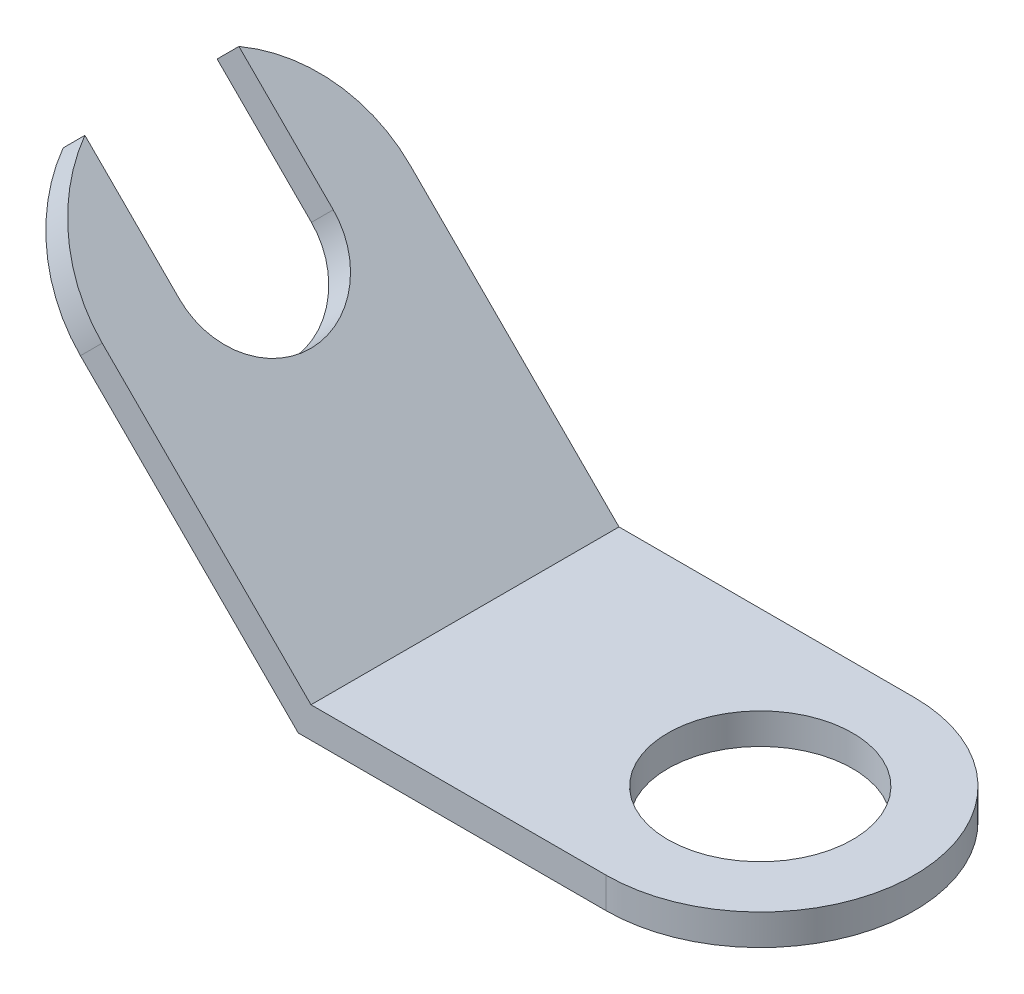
ISO-10303-21;
HEADER;
FILE_DESCRIPTION(('STEP AP214'),'2;1');
FILE_NAME('part.step','',(''),(''),'','','');
FILE_SCHEMA(('AUTOMOTIVE_DESIGN { 1 0 10303 214 1 1 1 1 }'));
ENDSEC;
DATA;
#1=APPLICATION_CONTEXT('core data for automotive mechanical design processes');
#2=APPLICATION_PROTOCOL_DEFINITION('international standard','automotive_design',2000,#1);
#3=PRODUCT_CONTEXT('',#1,'mechanical');
#4=PRODUCT('Part','Part','',(#3));
#5=PRODUCT_RELATED_PRODUCT_CATEGORY('part','',(#4));
#6=PRODUCT_DEFINITION_FORMATION('','',#4);
#7=PRODUCT_DEFINITION_CONTEXT('part definition',#1,'design');
#8=PRODUCT_DEFINITION('design','',#6,#7);
#9=PRODUCT_DEFINITION_SHAPE('','',#8);
#10=(LENGTH_UNIT() NAMED_UNIT(*) SI_UNIT(.MILLI.,.METRE.));
#11=(NAMED_UNIT(*) PLANE_ANGLE_UNIT() SI_UNIT($,.RADIAN.));
#12=(NAMED_UNIT(*) SI_UNIT($,.STERADIAN.) SOLID_ANGLE_UNIT());
#13=UNCERTAINTY_MEASURE_WITH_UNIT(LENGTH_MEASURE(1.E-05),#10,'distance_accuracy_value','');
#14=(GEOMETRIC_REPRESENTATION_CONTEXT(3) GLOBAL_UNCERTAINTY_ASSIGNED_CONTEXT((#13)) GLOBAL_UNIT_ASSIGNED_CONTEXT((#10,
#11,#12)) REPRESENTATION_CONTEXT('',''));
#15=CARTESIAN_POINT('',(0.,0.,0.));
#16=DIRECTION('',(0.,0.,1.));
#17=DIRECTION('',(1.,0.,0.));
#18=AXIS2_PLACEMENT_3D('',#15,#16,#17);
#19=CARTESIAN_POINT('',(-220.710678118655,70.7106781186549,0.));
#20=DIRECTION('',(-0.707106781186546,-0.707106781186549,0.));
#21=DIRECTION('',(0.707106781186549,-0.707106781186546,0.));
#22=AXIS2_PLACEMENT_3D('',#19,#20,#21);
#23=CYLINDRICAL_SURFACE('',#22,50.);
#24=DIRECTION('',(-0.707106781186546,-0.707106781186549,0.));
#25=VECTOR('',#24,1.);
#26=CARTESIAN_POINT('',(-251.329299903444,101.329299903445,25.));
#27=LINE('',#26,#25);
#28=CARTESIAN_POINT('',(-251.329299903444,101.329299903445,25.));
#29=VERTEX_POINT('',#28);
#30=CARTESIAN_POINT('',(-244.258232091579,108.40036771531,25.));
#31=VERTEX_POINT('',#30);
#32=EDGE_CURVE('E152',#29,#31,#27,.F.);
#33=ORIENTED_EDGE('',*,*,#32,.F.);
#34=CARTESIAN_POINT('',(-220.710678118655,70.7106781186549,0.));
#35=DIRECTION('',(0.707106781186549,0.707106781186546,0.));
#36=DIRECTION('',(-0.707106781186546,0.707106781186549,0.));
#37=AXIS2_PLACEMENT_3D('',#34,#35,#36);
#38=CIRCLE('',#37,50.);
#39=CARTESIAN_POINT('',(-220.710678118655,70.7106781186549,50.));
#40=VERTEX_POINT('',#39);
#41=EDGE_CURVE('E68',#40,#29,#38,.F.);
#42=ORIENTED_EDGE('',*,*,#41,.F.);
#43=DIRECTION('',(-0.707106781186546,-0.707106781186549,0.));
#44=VECTOR('',#43,1.);
#45=CARTESIAN_POINT('',(-140.710678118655,150.710678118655,50.));
#46=LINE('',#45,#44);
#47=CARTESIAN_POINT('',(-213.639610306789,77.7817459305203,50.));
#48=VERTEX_POINT('',#47);
#49=EDGE_CURVE('E192',#48,#40,#46,.T.);
#50=ORIENTED_EDGE('',*,*,#49,.F.);
#51=CARTESIAN_POINT('',(-213.639610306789,77.7817459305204,0.));
#52=DIRECTION('',(-0.707106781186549,-0.707106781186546,0.));
#53=DIRECTION('',(0.707106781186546,-0.707106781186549,0.));
#54=AXIS2_PLACEMENT_3D('',#51,#52,#53);
#55=CIRCLE('',#54,50.);
#56=EDGE_CURVE('E196',#31,#48,#55,.F.);
#57=ORIENTED_EDGE('',*,*,#56,.F.);
#58=EDGE_LOOP('',(#33,#42,#50,#57));
#59=FACE_BOUND('',#58,.T.);
#60=ADVANCED_FACE('F45',(#59),#23,.T.);
#61=DIRECTION('',(-0.707106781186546,-0.707106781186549,0.));
#62=VECTOR('',#61,1.);
#63=CARTESIAN_POINT('',(-251.329299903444,101.329299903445,-25.));
#64=LINE('',#63,#62);
#65=CARTESIAN_POINT('',(-244.258232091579,108.40036771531,-25.));
#66=VERTEX_POINT('',#65);
#67=CARTESIAN_POINT('',(-251.329299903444,101.329299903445,-25.));
#68=VERTEX_POINT('',#67);
#69=EDGE_CURVE('E60',#66,#68,#64,.T.);
#70=ORIENTED_EDGE('',*,*,#69,.F.);
#71=CARTESIAN_POINT('',(-213.639610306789,77.7817459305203,-50.));
#72=VERTEX_POINT('',#71);
#73=EDGE_CURVE('E145',#72,#66,#55,.F.);
#74=ORIENTED_EDGE('',*,*,#73,.F.);
#75=DIRECTION('',(0.707106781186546,0.707106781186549,0.));
#76=VECTOR('',#75,1.);
#77=CARTESIAN_POINT('',(-220.710678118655,70.7106781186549,-50.));
#78=LINE('',#77,#76);
#79=CARTESIAN_POINT('',(-220.710678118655,70.7106781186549,-50.));
#80=VERTEX_POINT('',#79);
#81=EDGE_CURVE('E189',#80,#72,#78,.T.);
#82=ORIENTED_EDGE('',*,*,#81,.F.);
#83=EDGE_CURVE('E194',#68,#80,#38,.F.);
#84=ORIENTED_EDGE('',*,*,#83,.F.);
#85=EDGE_LOOP('',(#70,#74,#82,#84));
#86=FACE_BOUND('',#85,.T.);
#87=ADVANCED_FACE('F47',(#86),#23,.T.);
#88=CARTESIAN_POINT('',(-50.,0.,0.));
#89=DIRECTION('',(0.,1.,0.));
#90=DIRECTION('',(0.,0.,1.));
#91=AXIS2_PLACEMENT_3D('',#88,#89,#90);
#92=CYLINDRICAL_SURFACE('',#91,50.);
#93=DIRECTION('',(0.,1.,0.));
#94=VECTOR('',#93,1.);
#95=CARTESIAN_POINT('',(-50.,10.,50.));
#96=LINE('',#95,#94);
#97=CARTESIAN_POINT('',(-50.,0.,50.));
#98=VERTEX_POINT('',#97);
#99=CARTESIAN_POINT('',(-50.,10.,50.));
#100=VERTEX_POINT('',#99);
#101=EDGE_CURVE('E179',#98,#100,#96,.T.);
#102=ORIENTED_EDGE('',*,*,#101,.F.);
#103=CARTESIAN_POINT('',(-50.,0.,0.));
#104=DIRECTION('',(0.,1.,0.));
#105=DIRECTION('',(-1.,0.,0.));
#106=AXIS2_PLACEMENT_3D('',#103,#104,#105);
#107=CIRCLE('',#106,50.);
#108=CARTESIAN_POINT('',(-50.,0.,-50.));
#109=VERTEX_POINT('',#108);
#110=EDGE_CURVE('E185',#109,#98,#107,.F.);
#111=ORIENTED_EDGE('',*,*,#110,.F.);
#112=DIRECTION('',(0.,-1.,0.));
#113=VECTOR('',#112,1.);
#114=CARTESIAN_POINT('',(-50.,0.,-50.));
#115=LINE('',#114,#113);
#116=CARTESIAN_POINT('',(-50.,10.,-50.));
#117=VERTEX_POINT('',#116);
#118=EDGE_CURVE('E182',#117,#109,#115,.T.);
#119=ORIENTED_EDGE('',*,*,#118,.F.);
#120=CARTESIAN_POINT('',(-50.,10.,0.));
#121=DIRECTION('',(0.,-1.,0.));
#122=DIRECTION('',(0.,0.,-1.));
#123=AXIS2_PLACEMENT_3D('',#120,#121,#122);
#124=CIRCLE('',#123,50.);
#125=EDGE_CURVE('E187',#100,#117,#124,.F.);
#126=ORIENTED_EDGE('',*,*,#125,.F.);
#127=EDGE_LOOP('',(#102,#111,#119,#126));
#128=FACE_BOUND('',#127,.T.);
#129=ADVANCED_FACE('F226',(#128),#92,.T.);
#130=CARTESIAN_POINT('',(0.,10.,50.));
#131=DIRECTION('',(0.,-1.,0.));
#132=DIRECTION('',(0.,0.,-1.));
#133=AXIS2_PLACEMENT_3D('',#130,#131,#132);
#134=PLANE('',#133);
#135=CARTESIAN_POINT('',(-50.,9.99999999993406,0.));
#136=DIRECTION('',(0.,1.,0.));
#137=DIRECTION('',(0.,0.,1.));
#138=AXIS2_PLACEMENT_3D('',#135,#136,#137);
#139=CIRCLE('',#138,30.);
#140=CARTESIAN_POINT('',(-50.,9.99999999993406,30.));
#141=VERTEX_POINT('',#140);
#142=EDGE_CURVE('E333',#141,#141,#139,.T.);
#143=ORIENTED_EDGE('',*,*,#142,.F.);
#144=EDGE_LOOP('',(#143));
#145=FACE_BOUND('',#144,.T.);
#146=DIRECTION('',(-1.,0.,0.));
#147=VECTOR('',#146,1.);
#148=CARTESIAN_POINT('',(0.,10.,50.));
#149=LINE('',#148,#147);
#150=CARTESIAN_POINT('',(-145.857864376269,10.,50.));
#151=VERTEX_POINT('',#150);
#152=EDGE_CURVE('E163',#100,#151,#149,.T.);
#153=ORIENTED_EDGE('',*,*,#152,.F.);
#154=ORIENTED_EDGE('',*,*,#125,.T.);
#155=DIRECTION('',(-1.,0.,0.));
#156=VECTOR('',#155,1.);
#157=CARTESIAN_POINT('',(0.,10.,-50.));
#158=LINE('',#157,#156);
#159=CARTESIAN_POINT('',(-145.857864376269,10.,-50.));
#160=VERTEX_POINT('',#159);
#161=EDGE_CURVE('E154',#117,#160,#158,.T.);
#162=ORIENTED_EDGE('',*,*,#161,.T.);
#163=DIRECTION('',(0.,0.,-1.));
#164=VECTOR('',#163,1.);
#165=CARTESIAN_POINT('',(-145.857864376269,10.,50.));
#166=LINE('',#165,#164);
#167=EDGE_CURVE('E176',#151,#160,#166,.T.);
#168=ORIENTED_EDGE('',*,*,#167,.F.);
#169=EDGE_LOOP('',(#153,#154,#162,#168));
#170=FACE_BOUND('',#169,.T.);
#171=ADVANCED_FACE('F227',(#145,#170),#134,.F.);
#172=CARTESIAN_POINT('',(-145.857864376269,10.,50.));
#173=DIRECTION('',(-0.707106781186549,-0.707106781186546,0.));
#174=DIRECTION('',(0.707106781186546,-0.707106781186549,0.));
#175=AXIS2_PLACEMENT_3D('',#172,#173,#174);
#176=PLANE('',#175);
#177=CARTESIAN_POINT('',(-213.639610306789,77.7817459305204,0.));
#178=DIRECTION('',(0.707106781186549,0.707106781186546,0.));
#179=DIRECTION('',(-0.707106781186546,0.707106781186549,0.));
#180=AXIS2_PLACEMENT_3D('',#177,#178,#179);
#181=CIRCLE('',#180,25.);
#182=CARTESIAN_POINT('',(-213.639610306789,77.7817459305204,25.));
#183=VERTEX_POINT('',#182);
#184=CARTESIAN_POINT('',(-213.639610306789,77.7817459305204,-25.));
#185=VERTEX_POINT('',#184);
#186=EDGE_CURVE('E134',#183,#185,#181,.T.);
#187=ORIENTED_EDGE('',*,*,#186,.F.);
#188=DIRECTION('',(0.707106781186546,-0.707106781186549,0.));
#189=VECTOR('',#188,1.);
#190=CARTESIAN_POINT('',(-213.639610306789,77.7817459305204,25.));
#191=LINE('',#190,#189);
#192=EDGE_CURVE('E131',#31,#183,#191,.T.);
#193=ORIENTED_EDGE('',*,*,#192,.F.);
#194=ORIENTED_EDGE('',*,*,#56,.T.);
#195=DIRECTION('',(-0.707106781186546,0.707106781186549,0.));
#196=VECTOR('',#195,1.);
#197=CARTESIAN_POINT('',(-145.857864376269,10.,50.));
#198=LINE('',#197,#196);
#199=EDGE_CURVE('E165',#151,#48,#198,.T.);
#200=ORIENTED_EDGE('',*,*,#199,.F.);
#201=ORIENTED_EDGE('',*,*,#167,.T.);
#202=DIRECTION('',(-0.707106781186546,0.707106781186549,0.));
#203=VECTOR('',#202,1.);
#204=CARTESIAN_POINT('',(-145.857864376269,10.,-50.));
#205=LINE('',#204,#203);
#206=EDGE_CURVE('E156',#160,#72,#205,.T.);
#207=ORIENTED_EDGE('',*,*,#206,.T.);
#208=ORIENTED_EDGE('',*,*,#73,.T.);
#209=DIRECTION('',(-0.707106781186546,0.707106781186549,0.));
#210=VECTOR('',#209,1.);
#211=CARTESIAN_POINT('',(-213.639610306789,77.7817459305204,-25.));
#212=LINE('',#211,#210);
#213=EDGE_CURVE('E126',#185,#66,#212,.T.);
#214=ORIENTED_EDGE('',*,*,#213,.F.);
#215=EDGE_LOOP('',(#187,#193,#194,#200,#201,#207,#208,#214));
#216=FACE_BOUND('',#215,.T.);
#217=ADVANCED_FACE('F143',(#216),#176,.F.);
#218=CARTESIAN_POINT('',(-150.,0.,50.));
#219=DIRECTION('',(0.707106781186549,0.707106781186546,0.));
#220=DIRECTION('',(-0.707106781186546,0.707106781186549,0.));
#221=AXIS2_PLACEMENT_3D('',#218,#219,#220);
#222=PLANE('',#221);
#223=ORIENTED_EDGE('',*,*,#41,.T.);
#224=DIRECTION('',(0.707106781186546,-0.707106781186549,0.));
#225=VECTOR('',#224,1.);
#226=CARTESIAN_POINT('',(-150.,0.,25.));
#227=LINE('',#226,#225);
#228=CARTESIAN_POINT('',(-220.710678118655,70.7106781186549,25.));
#229=VERTEX_POINT('',#228);
#230=EDGE_CURVE('E13',#29,#229,#227,.T.);
#231=ORIENTED_EDGE('',*,*,#230,.T.);
#232=CARTESIAN_POINT('',(-220.710678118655,70.7106781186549,0.));
#233=DIRECTION('',(0.707106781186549,0.707106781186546,0.));
#234=DIRECTION('',(-0.707106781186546,0.707106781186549,0.));
#235=AXIS2_PLACEMENT_3D('',#232,#233,#234);
#236=CIRCLE('',#235,25.);
#237=CARTESIAN_POINT('',(-220.710678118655,70.7106781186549,-25.));
#238=VERTEX_POINT('',#237);
#239=EDGE_CURVE('E53',#229,#238,#236,.T.);
#240=ORIENTED_EDGE('',*,*,#239,.T.);
#241=DIRECTION('',(-0.707106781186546,0.707106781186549,0.));
#242=VECTOR('',#241,1.);
#243=CARTESIAN_POINT('',(-150.,0.,-25.));
#244=LINE('',#243,#242);
#245=EDGE_CURVE('E127',#238,#68,#244,.T.);
#246=ORIENTED_EDGE('',*,*,#245,.T.);
#247=ORIENTED_EDGE('',*,*,#83,.T.);
#248=DIRECTION('',(0.707106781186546,-0.707106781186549,0.));
#249=VECTOR('',#248,1.);
#250=CARTESIAN_POINT('',(-150.,0.,-50.));
#251=LINE('',#250,#249);
#252=CARTESIAN_POINT('',(-150.,0.,-50.));
#253=VERTEX_POINT('',#252);
#254=EDGE_CURVE('E158',#80,#253,#251,.T.);
#255=ORIENTED_EDGE('',*,*,#254,.T.);
#256=DIRECTION('',(0.,0.,-1.));
#257=VECTOR('',#256,1.);
#258=CARTESIAN_POINT('',(-150.,0.,50.));
#259=LINE('',#258,#257);
#260=CARTESIAN_POINT('',(-150.,0.,50.));
#261=VERTEX_POINT('',#260);
#262=EDGE_CURVE('E173',#261,#253,#259,.T.);
#263=ORIENTED_EDGE('',*,*,#262,.F.);
#264=DIRECTION('',(0.707106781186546,-0.707106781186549,0.));
#265=VECTOR('',#264,1.);
#266=CARTESIAN_POINT('',(-150.,0.,50.));
#267=LINE('',#266,#265);
#268=EDGE_CURVE('E168',#40,#261,#267,.T.);
#269=ORIENTED_EDGE('',*,*,#268,.F.);
#270=EDGE_LOOP('',(#223,#231,#240,#246,#247,#255,#263,#269));
#271=FACE_BOUND('',#270,.T.);
#272=ADVANCED_FACE('F199',(#271),#222,.F.);
#273=CARTESIAN_POINT('',(0.,0.,50.));
#274=DIRECTION('',(0.,1.,0.));
#275=DIRECTION('',(-1.,0.,0.));
#276=AXIS2_PLACEMENT_3D('',#273,#274,#275);
#277=PLANE('',#276);
#278=CARTESIAN_POINT('',(-50.,0.,0.));
#279=DIRECTION('',(0.,1.,0.));
#280=DIRECTION('',(0.,0.,1.));
#281=AXIS2_PLACEMENT_3D('',#278,#279,#280);
#282=CIRCLE('',#281,30.);
#283=CARTESIAN_POINT('',(-50.,0.,30.));
#284=VERTEX_POINT('',#283);
#285=EDGE_CURVE('E140',#284,#284,#282,.T.);
#286=ORIENTED_EDGE('',*,*,#285,.T.);
#287=EDGE_LOOP('',(#286));
#288=FACE_BOUND('',#287,.T.);
#289=DIRECTION('',(1.,0.,0.));
#290=VECTOR('',#289,1.);
#291=CARTESIAN_POINT('',(0.,0.,-50.));
#292=LINE('',#291,#290);
#293=EDGE_CURVE('E160',#253,#109,#292,.T.);
#294=ORIENTED_EDGE('',*,*,#293,.T.);
#295=ORIENTED_EDGE('',*,*,#110,.T.);
#296=DIRECTION('',(1.,0.,0.));
#297=VECTOR('',#296,1.);
#298=CARTESIAN_POINT('',(0.,0.,50.));
#299=LINE('',#298,#297);
#300=EDGE_CURVE('E170',#261,#98,#299,.T.);
#301=ORIENTED_EDGE('',*,*,#300,.F.);
#302=ORIENTED_EDGE('',*,*,#262,.T.);
#303=EDGE_LOOP('',(#294,#295,#301,#302));
#304=FACE_BOUND('',#303,.T.);
#305=ADVANCED_FACE('F222',(#288,#304),#277,.F.);
#306=CARTESIAN_POINT('',(0.,10.,50.));
#307=DIRECTION('',(0.,0.,-1.));
#308=DIRECTION('',(-1.,0.,0.));
#309=AXIS2_PLACEMENT_3D('',#306,#307,#308);
#310=PLANE('',#309);
#311=ORIENTED_EDGE('',*,*,#199,.T.);
#312=ORIENTED_EDGE('',*,*,#49,.T.);
#313=ORIENTED_EDGE('',*,*,#268,.T.);
#314=ORIENTED_EDGE('',*,*,#300,.T.);
#315=ORIENTED_EDGE('',*,*,#101,.T.);
#316=ORIENTED_EDGE('',*,*,#152,.T.);
#317=EDGE_LOOP('',(#311,#312,#313,#314,#315,#316));
#318=FACE_BOUND('',#317,.T.);
#319=ADVANCED_FACE('F207',(#318),#310,.F.);
#320=CARTESIAN_POINT('',(0.,10.,-50.));
#321=DIRECTION('',(0.,0.,-1.));
#322=DIRECTION('',(-1.,0.,0.));
#323=AXIS2_PLACEMENT_3D('',#320,#321,#322);
#324=PLANE('',#323);
#325=ORIENTED_EDGE('',*,*,#254,.F.);
#326=ORIENTED_EDGE('',*,*,#81,.T.);
#327=ORIENTED_EDGE('',*,*,#206,.F.);
#328=ORIENTED_EDGE('',*,*,#161,.F.);
#329=ORIENTED_EDGE('',*,*,#118,.T.);
#330=ORIENTED_EDGE('',*,*,#293,.F.);
#331=EDGE_LOOP('',(#325,#326,#327,#328,#329,#330));
#332=FACE_BOUND('',#331,.T.);
#333=ADVANCED_FACE('F215',(#332),#324,.T.);
#334=CARTESIAN_POINT('',(-273.743686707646,17.6776695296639,0.));
#335=DIRECTION('',(0.707106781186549,0.707106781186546,0.));
#336=DIRECTION('',(-0.707106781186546,0.707106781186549,0.));
#337=AXIS2_PLACEMENT_3D('',#334,#335,#336);
#338=CYLINDRICAL_SURFACE('',#337,25.);
#339=DIRECTION('',(0.707106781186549,0.707106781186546,0.));
#340=VECTOR('',#339,1.);
#341=CARTESIAN_POINT('',(-273.743686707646,17.6776695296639,25.));
#342=LINE('',#341,#340);
#343=EDGE_CURVE('E130',#229,#183,#342,.T.);
#344=ORIENTED_EDGE('',*,*,#343,.T.);
#345=ORIENTED_EDGE('',*,*,#186,.T.);
#346=DIRECTION('',(0.707106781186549,0.707106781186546,0.));
#347=VECTOR('',#346,1.);
#348=CARTESIAN_POINT('',(-273.743686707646,17.6776695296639,-25.));
#349=LINE('',#348,#347);
#350=EDGE_CURVE('E122',#238,#185,#349,.T.);
#351=ORIENTED_EDGE('',*,*,#350,.F.);
#352=ORIENTED_EDGE('',*,*,#239,.F.);
#353=EDGE_LOOP('',(#344,#345,#351,#352));
#354=FACE_BOUND('',#353,.T.);
#355=ADVANCED_FACE('F135',(#354),#338,.F.);
#356=CARTESIAN_POINT('',(-273.743686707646,17.6776695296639,25.));
#357=DIRECTION('',(0.,0.,1.));
#358=DIRECTION('',(1.,0.,0.));
#359=AXIS2_PLACEMENT_3D('',#356,#357,#358);
#360=PLANE('',#359);
#361=ORIENTED_EDGE('',*,*,#32,.T.);
#362=ORIENTED_EDGE('',*,*,#192,.T.);
#363=ORIENTED_EDGE('',*,*,#343,.F.);
#364=ORIENTED_EDGE('',*,*,#230,.F.);
#365=EDGE_LOOP('',(#361,#362,#363,#364));
#366=FACE_BOUND('',#365,.T.);
#367=ADVANCED_FACE('F202',(#366),#360,.F.);
#368=CARTESIAN_POINT('',(-273.743686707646,17.6776695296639,-25.));
#369=DIRECTION('',(0.,0.,-1.));
#370=DIRECTION('',(-1.,0.,0.));
#371=AXIS2_PLACEMENT_3D('',#368,#369,#370);
#372=PLANE('',#371);
#373=ORIENTED_EDGE('',*,*,#69,.T.);
#374=ORIENTED_EDGE('',*,*,#245,.F.);
#375=ORIENTED_EDGE('',*,*,#350,.T.);
#376=ORIENTED_EDGE('',*,*,#213,.T.);
#377=EDGE_LOOP('',(#373,#374,#375,#376));
#378=FACE_BOUND('',#377,.T.);
#379=ADVANCED_FACE('F124',(#378),#372,.F.);
#380=CARTESIAN_POINT('',(-50.,0.,0.));
#381=DIRECTION('',(0.,1.,0.));
#382=DIRECTION('',(0.,0.,1.));
#383=AXIS2_PLACEMENT_3D('',#380,#381,#382);
#384=CYLINDRICAL_SURFACE('',#383,30.);
#385=ORIENTED_EDGE('',*,*,#285,.F.);
#386=EDGE_LOOP('',(#385));
#387=FACE_BOUND('',#386,.T.);
#388=ORIENTED_EDGE('',*,*,#142,.T.);
#389=EDGE_LOOP('',(#388));
#390=FACE_BOUND('',#389,.T.);
#391=ADVANCED_FACE('F297',(#387,#390),#384,.F.);
#392=CLOSED_SHELL('',(#60,#87,#129,#171,#217,#272,#305,#319,#333,#355,#367,#379,#391));
#393=MANIFOLD_SOLID_BREP('B2',#392);
#394=ADVANCED_BREP_SHAPE_REPRESENTATION('',(#18,#393),#14);
#395=SHAPE_DEFINITION_REPRESENTATION(#9,#394);
ENDSEC;
END-ISO-10303-21;
